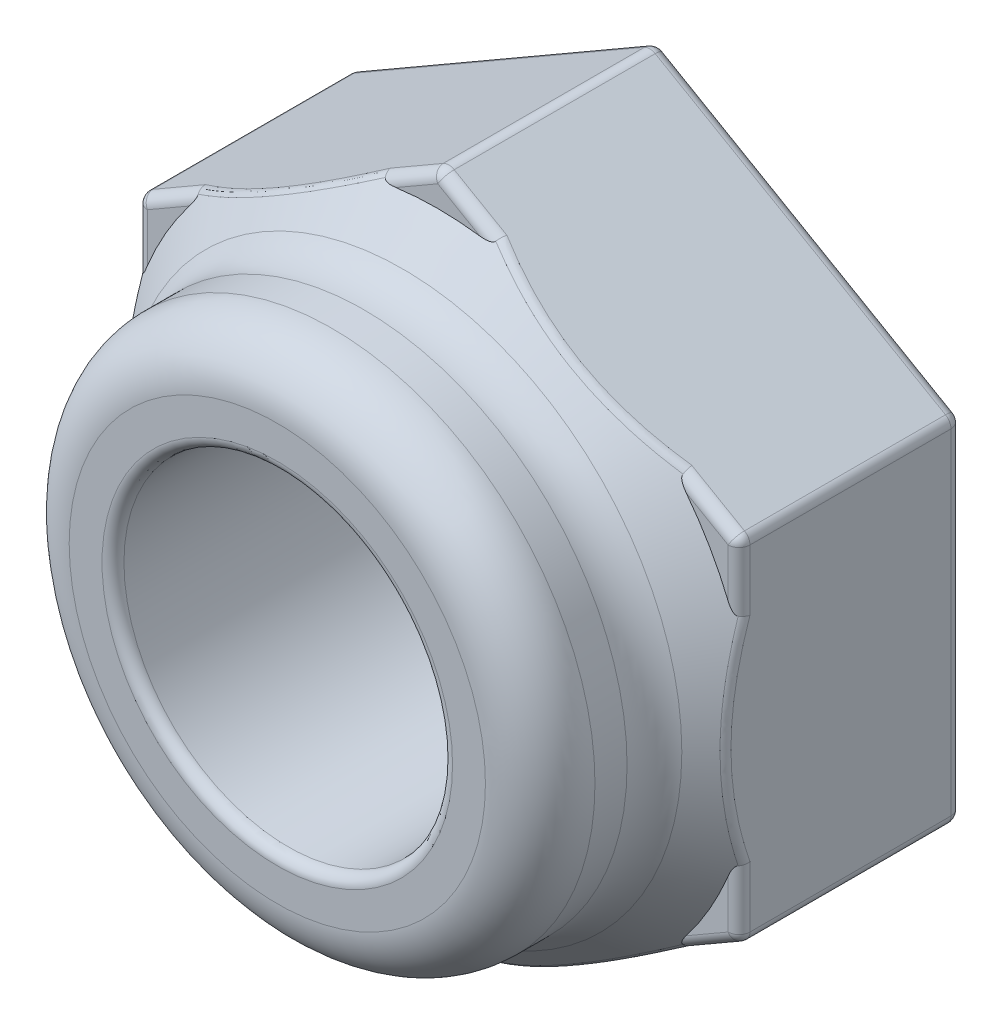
from build123d import *

# Parameters (mm, degrees)
EXTRUSION1_DEPTH                = 2.5
ESQUISSE3_R                     = 2.4
EXTRUSION2_DEPTH                = 1
CONG_1_R                        = 0.5
TROU_TARAUD_M3X0_51_D           = 2.5
TROU_TARAUD_M3X0_51_DEPTH       = 8.5
TROU_TARAUD_M3X0_51_CBORE_D     = 3
TROU_TARAUD_M3X0_51_CBORE_DEPTH = 6
TROU_TARAUD_M3X0_51_TIP         = 0.751075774
CONG_2_R                        = 0.1


with BuildPart() as part:
    # Esquisse1 → Extrusion1 (new body)
    with BuildSketch(Plane.XY):
        Polygon((0, 3.175426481), (-2.75, 1.58771324), (-2.75, -1.58771324), (0, -3.175426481), (2.75, -1.58771324), (2.75, 1.58771324), align=None)
    extrude(amount=EXTRUSION1_DEPTH)

    # Esquisse2 → Enl_vement de mati_re-R_volution1 (revolve, cut)
    with BuildSketch(Plane(origin=(0, 0, 0), x_dir=(1, 0, 0), z_dir=(0, 1, 0))):
        Polygon((2.4, -2.5), (2.864952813, -2.035047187), (4.126388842, -2.035047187), (4.126388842, -2.5), align=None)
    revolve(axis=Axis((0, 0, 0), (0, 0, 1)), mode=Mode.SUBTRACT)

    # Esquisse3 → Extrusion2 (add)
    with BuildSketch(Plane.XY.offset(2.5)):
        Circle(ESQUISSE3_R)
    extrude(amount=EXTRUSION2_DEPTH)

    # Cong_1
    cong_1_edges = [part.edges().sort_by_distance(p)[0] for p in [
        (-2.4, 0, 2.5),
        (-2.4, 0, 3.5),
    ]]
    fillet(cong_1_edges, radius=CONG_1_R)

    # Trou taraud_ M3x0.51
    with Locations(Plane.XY.offset(3.5)):
        with Locations((0, 0)):
            CounterBoreHole(TROU_TARAUD_M3X0_51_D / 2, TROU_TARAUD_M3X0_51_CBORE_D / 2, TROU_TARAUD_M3X0_51_CBORE_DEPTH, depth=TROU_TARAUD_M3X0_51_DEPTH)
            with Locations((0, 0, -(TROU_TARAUD_M3X0_51_DEPTH + TROU_TARAUD_M3X0_51_TIP / 2))):  # 118° drill point
                Cone(0, TROU_TARAUD_M3X0_51_D / 2, TROU_TARAUD_M3X0_51_TIP, mode=Mode.SUBTRACT)

    # Cong_2
    cong_2_edges = [part.edges().sort_by_distance(p)[0] for p in [
        (2.75, 0.405628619, 2.120245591),
        (2.75, -0.405628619, 2.120245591),
        (1.375, 2.38156986, 2.15),
        (1.375, -2.38156986, 2.15),
        (-1.375, 2.38156986, 2.15),
        (-1.375, -2.38156986, 2.15),
        (-2.75, 0, 2.15),
        (2.75, 0, 0),
        (2.75, 1.58771324, 1.017523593),
        (2.75, 1.195557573, 2.035047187),
        (2.75, -1.195557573, 2.035047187),
        (2.75, -1.58771324, 1.017523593),
        (2.41038323, 1.783791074, 2.035047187),
        (1.375, 2.38156986, 0),
        (0, 3.175426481, 1.017523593),
        (0.33961677, 2.979348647, 2.035047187),
        (2.41038323, -1.783791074, 2.035047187),
        (-0.33961677, 2.979348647, 2.035047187),
        (1.375, -2.38156986, 0),
        (0.33961677, -2.979348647, 2.035047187),
        (0, -3.175426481, 1.017523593),
        (-1.375, 2.38156986, 0),
        (-2.75, 1.58771324, 1.017523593),
        (-2.41038323, 1.783791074, 2.035047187),
        (-0.33961677, -2.979348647, 2.035047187),
        (-2.75, 1.195557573, 2.035047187),
        (-1.375, -2.38156986, 0),
        (-2.41038323, -1.783791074, 2.035047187),
        (-2.75, -1.58771324, 1.017523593),
        (-2.75, 0, 0),
        (-2.75, -1.195557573, 2.035047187),
        (-1.5, 0, 0),
        (-1.5, 0, 3.5),
    ]]
    fillet(cong_2_edges, radius=CONG_2_R)


solid = part.part
